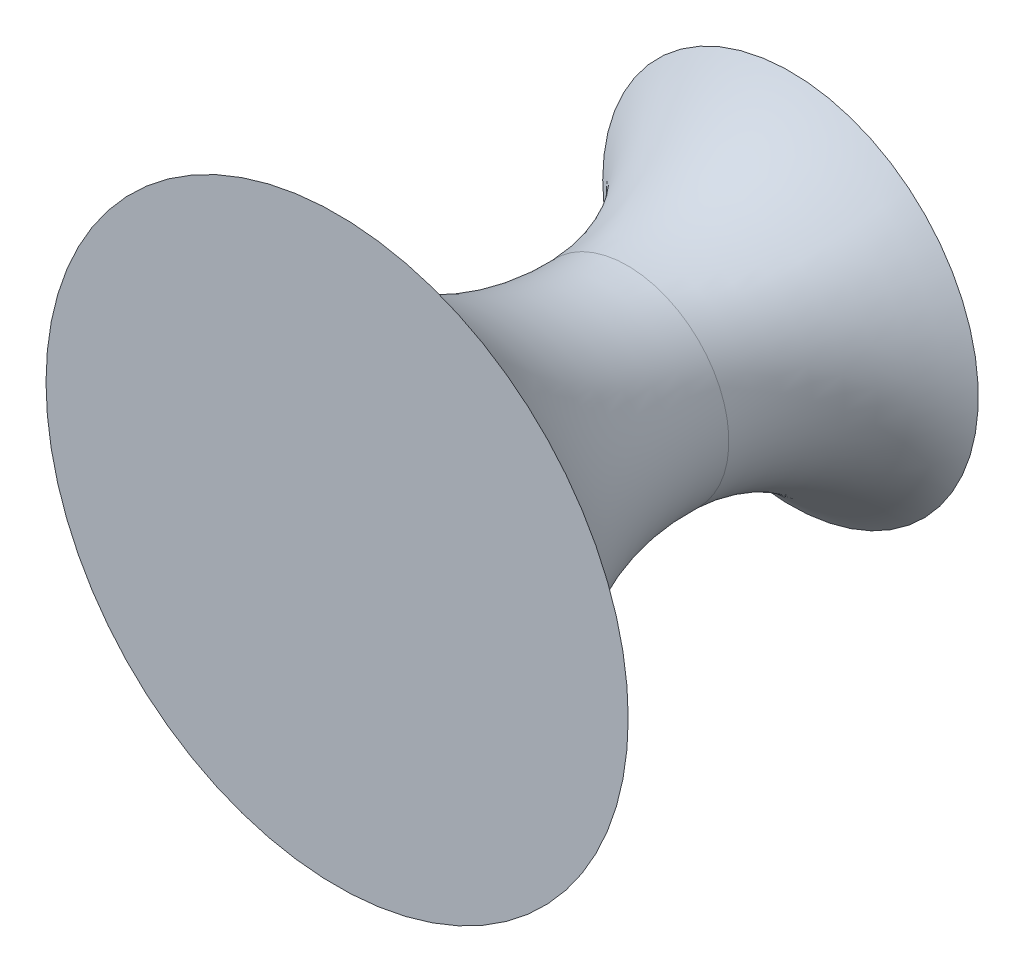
ISO-10303-21;
HEADER;
FILE_DESCRIPTION(('STEP AP214'),'2;1');
FILE_NAME('part.step','',(''),(''),'','','');
FILE_SCHEMA(('AUTOMOTIVE_DESIGN { 1 0 10303 214 1 1 1 1 }'));
ENDSEC;
DATA;
#1=APPLICATION_CONTEXT('core data for automotive mechanical design processes');
#2=APPLICATION_PROTOCOL_DEFINITION('international standard','automotive_design',2000,#1);
#3=PRODUCT_CONTEXT('',#1,'mechanical');
#4=PRODUCT('Part','Part','',(#3));
#5=PRODUCT_RELATED_PRODUCT_CATEGORY('part','',(#4));
#6=PRODUCT_DEFINITION_FORMATION('','',#4);
#7=PRODUCT_DEFINITION_CONTEXT('part definition',#1,'design');
#8=PRODUCT_DEFINITION('design','',#6,#7);
#9=PRODUCT_DEFINITION_SHAPE('','',#8);
#10=(LENGTH_UNIT() NAMED_UNIT(*) SI_UNIT(.MILLI.,.METRE.));
#11=(NAMED_UNIT(*) PLANE_ANGLE_UNIT() SI_UNIT($,.RADIAN.));
#12=(NAMED_UNIT(*) SI_UNIT($,.STERADIAN.) SOLID_ANGLE_UNIT());
#13=UNCERTAINTY_MEASURE_WITH_UNIT(LENGTH_MEASURE(1.E-05),#10,'distance_accuracy_value','');
#14=(GEOMETRIC_REPRESENTATION_CONTEXT(3) GLOBAL_UNCERTAINTY_ASSIGNED_CONTEXT((#13)) GLOBAL_UNIT_ASSIGNED_CONTEXT((#10,
#11,#12)) REPRESENTATION_CONTEXT('',''));
#15=CARTESIAN_POINT('',(0.,0.,0.));
#16=DIRECTION('',(0.,0.,1.));
#17=DIRECTION('',(1.,0.,0.));
#18=AXIS2_PLACEMENT_3D('',#15,#16,#17);
#19=CARTESIAN_POINT('',(-62.,0.,39.781248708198));
#20=DIRECTION('',(0.,0.,1.));
#21=DIRECTION('',(1.,0.,0.));
#22=AXIS2_PLACEMENT_3D('',#19,#20,#21);
#23=PLANE('',#22);
#24=CARTESIAN_POINT('',(0.,0.,39.781248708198));
#25=DIRECTION('',(0.,0.,-1.));
#26=DIRECTION('',(-1.,0.,0.));
#27=AXIS2_PLACEMENT_3D('',#24,#25,#26);
#28=CIRCLE('',#27,62.);
#29=CARTESIAN_POINT('',(-62.,0.,39.781248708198));
#30=VERTEX_POINT('',#29);
#31=EDGE_CURVE('E10',#30,#30,#28,.T.);
#32=ORIENTED_EDGE('',*,*,#31,.F.);
#33=EDGE_LOOP('',(#32));
#34=FACE_BOUND('',#33,.T.);
#35=ADVANCED_FACE('F29',(#34),#23,.T.);
#36=CARTESIAN_POINT('',(0.,0.,-19.8222939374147));
#37=DIRECTION('',(0.,0.,-1.));
#38=DIRECTION('',(-1.,0.,0.));
#39=AXIS2_PLACEMENT_3D('',#36,#37,#38);
#40=TOROIDAL_SURFACE('',#39,85.7475598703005,64.1601815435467);
#41=ORIENTED_EDGE('',*,*,#31,.T.);
#42=EDGE_LOOP('',(#41));
#43=FACE_BOUND('',#42,.T.);
#44=CARTESIAN_POINT('',(0.,0.,-22.021059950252));
#45=DIRECTION('',(0.,0.,-1.));
#46=DIRECTION('',(-1.,0.,0.));
#47=AXIS2_PLACEMENT_3D('',#44,#45,#46);
#48=CIRCLE('',#47,21.6250651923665);
#49=CARTESIAN_POINT('',(-21.6250651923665,0.,-22.021059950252));
#50=VERTEX_POINT('',#49);
#51=EDGE_CURVE('E35',#50,#50,#48,.T.);
#52=ORIENTED_EDGE('',*,*,#51,.F.);
#53=EDGE_LOOP('',(#52));
#54=FACE_BOUND('',#53,.T.);
#55=ADVANCED_FACE('F50',(#43,#54),#40,.F.);
#56=CARTESIAN_POINT('',(0.,0.,-20.4789123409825));
#57=DIRECTION('',(0.,0.,-1.));
#58=DIRECTION('',(-1.,0.,0.));
#59=AXIS2_PLACEMENT_3D('',#56,#57,#58);
#60=TOROIDAL_SURFACE('',#59,66.5986327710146,45.);
#61=ORIENTED_EDGE('',*,*,#51,.T.);
#62=EDGE_LOOP('',(#61));
#63=FACE_BOUND('',#62,.T.);
#64=CARTESIAN_POINT('',(0.,0.,-56.7764705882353));
#65=DIRECTION('',(0.,0.,-1.));
#66=DIRECTION('',(-1.,0.,0.));
#67=AXIS2_PLACEMENT_3D('',#64,#65,#66);
#68=CIRCLE('',#67,40.);
#69=CARTESIAN_POINT('',(-40.,0.,-56.7764705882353));
#70=VERTEX_POINT('',#69);
#71=EDGE_CURVE('E39',#70,#70,#68,.T.);
#72=ORIENTED_EDGE('',*,*,#71,.F.);
#73=EDGE_LOOP('',(#72));
#74=FACE_BOUND('',#73,.T.);
#75=ADVANCED_FACE('F48',(#63,#74),#60,.F.);
#76=CARTESIAN_POINT('',(0.,0.,-56.7764705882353));
#77=DIRECTION('',(0.,0.,-1.));
#78=DIRECTION('',(-1.,0.,0.));
#79=AXIS2_PLACEMENT_3D('',#76,#77,#78);
#80=PLANE('',#79);
#81=ORIENTED_EDGE('',*,*,#71,.T.);
#82=EDGE_LOOP('',(#81));
#83=FACE_BOUND('',#82,.T.);
#84=ADVANCED_FACE('F46',(#83),#80,.T.);
#85=CLOSED_SHELL('',(#35,#55,#75,#84));
#86=MANIFOLD_SOLID_BREP('B2',#85);
#87=ADVANCED_BREP_SHAPE_REPRESENTATION('',(#18,#86),#14);
#88=SHAPE_DEFINITION_REPRESENTATION(#9,#87);
ENDSEC;
END-ISO-10303-21;
